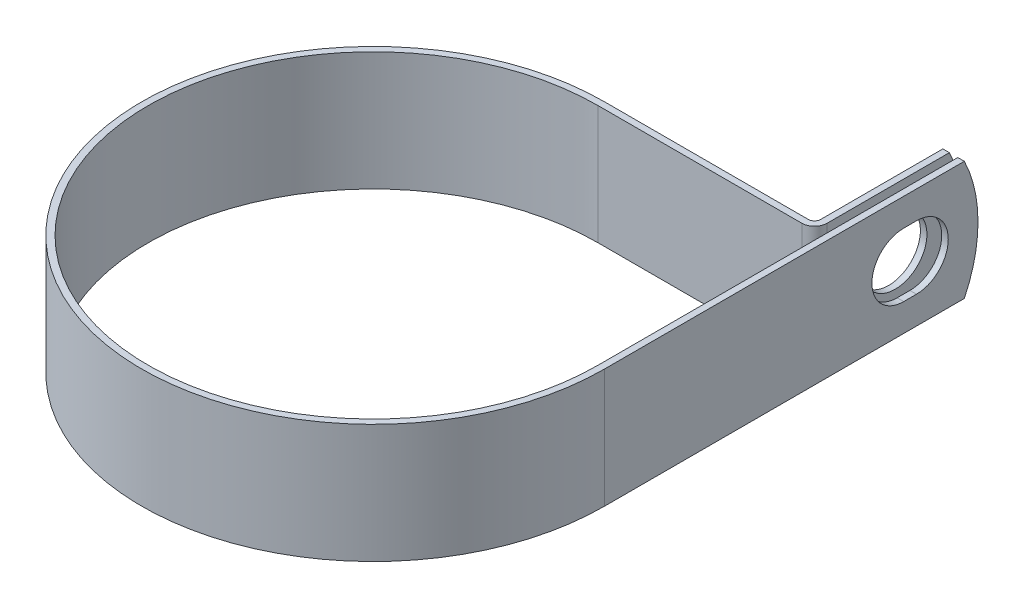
ISO-10303-21;
HEADER;
FILE_DESCRIPTION(('STEP AP214'),'2;1');
FILE_NAME('part.step','',(''),(''),'','','');
FILE_SCHEMA(('AUTOMOTIVE_DESIGN { 1 0 10303 214 1 1 1 1 }'));
ENDSEC;
DATA;
#1=APPLICATION_CONTEXT('core data for automotive mechanical design processes');
#2=APPLICATION_PROTOCOL_DEFINITION('international standard','automotive_design',2000,#1);
#3=PRODUCT_CONTEXT('',#1,'mechanical');
#4=PRODUCT('Part','Part','',(#3));
#5=PRODUCT_RELATED_PRODUCT_CATEGORY('part','',(#4));
#6=PRODUCT_DEFINITION_FORMATION('','',#4);
#7=PRODUCT_DEFINITION_CONTEXT('part definition',#1,'design');
#8=PRODUCT_DEFINITION('design','',#6,#7);
#9=PRODUCT_DEFINITION_SHAPE('','',#8);
#10=(LENGTH_UNIT() NAMED_UNIT(*) SI_UNIT(.MILLI.,.METRE.));
#11=(NAMED_UNIT(*) PLANE_ANGLE_UNIT() SI_UNIT($,.RADIAN.));
#12=(NAMED_UNIT(*) SI_UNIT($,.STERADIAN.) SOLID_ANGLE_UNIT());
#13=UNCERTAINTY_MEASURE_WITH_UNIT(LENGTH_MEASURE(1.E-05),#10,'distance_accuracy_value','');
#14=(GEOMETRIC_REPRESENTATION_CONTEXT(3) GLOBAL_UNCERTAINTY_ASSIGNED_CONTEXT((#13)) GLOBAL_UNIT_ASSIGNED_CONTEXT((#10,
#11,#12)) REPRESENTATION_CONTEXT('',''));
#15=CARTESIAN_POINT('',(0.,0.,0.));
#16=DIRECTION('',(0.,0.,1.));
#17=DIRECTION('',(1.,0.,0.));
#18=AXIS2_PLACEMENT_3D('',#15,#16,#17);
#19=CARTESIAN_POINT('',(42.0624,11.1125,0.));
#20=DIRECTION('',(-1.,0.,0.));
#21=DIRECTION('',(0.,0.,1.));
#22=AXIS2_PLACEMENT_3D('',#19,#20,#21);
#23=PLANE('',#22);
#24=DIRECTION('',(0.,0.,-1.));
#25=VECTOR('',#24,1.);
#26=CARTESIAN_POINT('',(42.0624,-5.9436,-55.9561999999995));
#27=LINE('',#26,#25);
#28=CARTESIAN_POINT('',(42.0624,-5.9436,-55.9561999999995));
#29=VERTEX_POINT('',#28);
#30=CARTESIAN_POINT('',(42.0624,-5.9436,-58.3438000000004));
#31=VERTEX_POINT('',#30);
#32=EDGE_CURVE('E236',#29,#31,#27,.T.);
#33=ORIENTED_EDGE('',*,*,#32,.T.);
#34=CARTESIAN_POINT('',(42.0624,0.,-58.3437999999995));
#35=DIRECTION('',(-1.,0.,0.));
#36=DIRECTION('',(0.,0.,1.));
#37=AXIS2_PLACEMENT_3D('',#34,#35,#36);
#38=CIRCLE('',#37,5.9436);
#39=CARTESIAN_POINT('',(42.0624,5.9436,-58.3438000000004));
#40=VERTEX_POINT('',#39);
#41=EDGE_CURVE('E257',#31,#40,#38,.F.);
#42=ORIENTED_EDGE('',*,*,#41,.T.);
#43=DIRECTION('',(0.,0.,1.));
#44=VECTOR('',#43,1.);
#45=CARTESIAN_POINT('',(42.0624,5.9436,-55.9561999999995));
#46=LINE('',#45,#44);
#47=CARTESIAN_POINT('',(42.0624,5.9436,-55.9561999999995));
#48=VERTEX_POINT('',#47);
#49=EDGE_CURVE('E253',#40,#48,#46,.T.);
#50=ORIENTED_EDGE('',*,*,#49,.T.);
#51=CARTESIAN_POINT('',(42.0624,0.,-55.9561999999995));
#52=DIRECTION('',(-1.,0.,0.));
#53=DIRECTION('',(0.,0.,1.));
#54=AXIS2_PLACEMENT_3D('',#51,#52,#53);
#55=CIRCLE('',#54,5.9436);
#56=EDGE_CURVE('E248',#48,#29,#55,.F.);
#57=ORIENTED_EDGE('',*,*,#56,.T.);
#58=EDGE_LOOP('',(#33,#42,#50,#57));
#59=FACE_BOUND('',#58,.T.);
#60=CARTESIAN_POINT('',(42.0624,0.,-44.45));
#61=DIRECTION('',(-1.,0.,0.));
#62=DIRECTION('',(0.,0.,1.));
#63=AXIS2_PLACEMENT_3D('',#60,#61,#62);
#64=CIRCLE('',#63,25.4);
#65=CARTESIAN_POINT('',(42.0624,11.1125,-67.2901476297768));
#66=VERTEX_POINT('',#65);
#67=CARTESIAN_POINT('',(42.0624,-11.1125,-67.2901476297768));
#68=VERTEX_POINT('',#67);
#69=EDGE_CURVE('E75',#66,#68,#64,.T.);
#70=ORIENTED_EDGE('',*,*,#69,.T.);
#71=DIRECTION('',(0.,0.,-1.));
#72=VECTOR('',#71,1.);
#73=CARTESIAN_POINT('',(42.0624,-11.1125,0.));
#74=LINE('',#73,#72);
#75=CARTESIAN_POINT('',(42.0624,-11.1125,0.));
#76=VERTEX_POINT('',#75);
#77=EDGE_CURVE('E271',#76,#68,#74,.T.);
#78=ORIENTED_EDGE('',*,*,#77,.F.);
#79=DIRECTION('',(0.,-1.,0.));
#80=VECTOR('',#79,1.);
#81=CARTESIAN_POINT('',(42.0624,11.1125,0.));
#82=LINE('',#81,#80);
#83=CARTESIAN_POINT('',(42.0624,11.1125,0.));
#84=VERTEX_POINT('',#83);
#85=EDGE_CURVE('E218',#84,#76,#82,.T.);
#86=ORIENTED_EDGE('',*,*,#85,.F.);
#87=DIRECTION('',(0.,0.,-1.));
#88=VECTOR('',#87,1.);
#89=CARTESIAN_POINT('',(42.0624,11.1125,-42.0624));
#90=LINE('',#89,#88);
#91=EDGE_CURVE('E273',#84,#66,#90,.T.);
#92=ORIENTED_EDGE('',*,*,#91,.T.);
#93=EDGE_LOOP('',(#70,#78,#86,#92));
#94=FACE_BOUND('',#93,.T.);
#95=ADVANCED_FACE('F54',(#59,#94),#23,.T.);
#96=CARTESIAN_POINT('',(40.4876,11.1125,-69.85));
#97=DIRECTION('',(1.,0.,0.));
#98=DIRECTION('',(0.,0.,-1.));
#99=AXIS2_PLACEMENT_3D('',#96,#97,#98);
#100=PLANE('',#99);
#101=CARTESIAN_POINT('',(40.4876,0.,-57.15));
#102=DIRECTION('',(1.,0.,0.));
#103=DIRECTION('',(0.,0.,-1.));
#104=AXIS2_PLACEMENT_3D('',#101,#102,#103);
#105=CIRCLE('',#104,5.9436);
#106=CARTESIAN_POINT('',(40.4876,0.,-63.0936));
#107=VERTEX_POINT('',#106);
#108=EDGE_CURVE('E268',#107,#107,#105,.F.);
#109=ORIENTED_EDGE('',*,*,#108,.T.);
#110=EDGE_LOOP('',(#109));
#111=FACE_BOUND('',#110,.T.);
#112=DIRECTION('',(0.,0.,1.));
#113=VECTOR('',#112,1.);
#114=CARTESIAN_POINT('',(40.4876,-11.1125,-69.85));
#115=LINE('',#114,#113);
#116=CARTESIAN_POINT('',(40.4876,-11.1125,-67.2901476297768));
#117=VERTEX_POINT('',#116);
#118=CARTESIAN_POINT('',(40.4876,-11.1125,-44.43984));
#119=VERTEX_POINT('',#118);
#120=EDGE_CURVE('E184',#117,#119,#115,.T.);
#121=ORIENTED_EDGE('',*,*,#120,.F.);
#122=CARTESIAN_POINT('',(40.4876,0.,-44.45));
#123=DIRECTION('',(1.,0.,0.));
#124=DIRECTION('',(0.,0.,-1.));
#125=AXIS2_PLACEMENT_3D('',#122,#123,#124);
#126=CIRCLE('',#125,25.4);
#127=CARTESIAN_POINT('',(40.4876,11.1125,-67.2901476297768));
#128=VERTEX_POINT('',#127);
#129=EDGE_CURVE('E176',#117,#128,#126,.T.);
#130=ORIENTED_EDGE('',*,*,#129,.T.);
#131=DIRECTION('',(0.,0.,1.));
#132=VECTOR('',#131,1.);
#133=CARTESIAN_POINT('',(40.4876,11.1125,-69.85));
#134=LINE('',#133,#132);
#135=CARTESIAN_POINT('',(40.4876,11.1125,-44.43984));
#136=VERTEX_POINT('',#135);
#137=EDGE_CURVE('E224',#128,#136,#134,.T.);
#138=ORIENTED_EDGE('',*,*,#137,.T.);
#139=DIRECTION('',(0.,-1.,0.));
#140=VECTOR('',#139,1.);
#141=CARTESIAN_POINT('',(40.4876,11.1125,-44.43984));
#142=LINE('',#141,#140);
#143=EDGE_CURVE('E211',#136,#119,#142,.T.);
#144=ORIENTED_EDGE('',*,*,#143,.T.);
#145=EDGE_LOOP('',(#121,#130,#138,#144));
#146=FACE_BOUND('',#145,.T.);
#147=ADVANCED_FACE('F226',(#111,#146),#100,.T.);
#148=CARTESIAN_POINT('',(39.2684,11.1125,-69.85));
#149=DIRECTION('',(1.,0.,0.));
#150=DIRECTION('',(0.,0.,-1.));
#151=AXIS2_PLACEMENT_3D('',#148,#149,#150);
#152=PLANE('',#151);
#153=CARTESIAN_POINT('',(39.2684,0.,-57.15));
#154=DIRECTION('',(-1.,0.,0.));
#155=DIRECTION('',(0.,0.,1.));
#156=AXIS2_PLACEMENT_3D('',#153,#154,#155);
#157=CIRCLE('',#156,5.9436);
#158=CARTESIAN_POINT('',(39.2684,0.,-51.2064));
#159=VERTEX_POINT('',#158);
#160=EDGE_CURVE('E265',#159,#159,#157,.T.);
#161=ORIENTED_EDGE('',*,*,#160,.F.);
#162=EDGE_LOOP('',(#161));
#163=FACE_BOUND('',#162,.T.);
#164=CARTESIAN_POINT('',(39.2684,0.,-44.45));
#165=DIRECTION('',(-1.,0.,0.));
#166=DIRECTION('',(0.,0.,1.));
#167=AXIS2_PLACEMENT_3D('',#164,#165,#166);
#168=CIRCLE('',#167,25.4);
#169=CARTESIAN_POINT('',(39.2684,11.1125,-67.2901476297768));
#170=VERTEX_POINT('',#169);
#171=CARTESIAN_POINT('',(39.2684,-11.1125,-67.2901476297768));
#172=VERTEX_POINT('',#171);
#173=EDGE_CURVE('E67',#170,#172,#168,.T.);
#174=ORIENTED_EDGE('',*,*,#173,.T.);
#175=DIRECTION('',(0.,0.,1.));
#176=VECTOR('',#175,1.);
#177=CARTESIAN_POINT('',(39.2684,-11.1125,-69.85));
#178=LINE('',#177,#176);
#179=CARTESIAN_POINT('',(39.2684,-11.1125,-44.43984));
#180=VERTEX_POINT('',#179);
#181=EDGE_CURVE('E167',#172,#180,#178,.T.);
#182=ORIENTED_EDGE('',*,*,#181,.T.);
#183=DIRECTION('',(0.,-1.,0.));
#184=VECTOR('',#183,1.);
#185=CARTESIAN_POINT('',(39.2684,11.1125,-44.43984));
#186=LINE('',#185,#184);
#187=CARTESIAN_POINT('',(39.2684,11.1125,-44.43984));
#188=VERTEX_POINT('',#187);
#189=EDGE_CURVE('E209',#188,#180,#186,.T.);
#190=ORIENTED_EDGE('',*,*,#189,.F.);
#191=DIRECTION('',(0.,0.,1.));
#192=VECTOR('',#191,1.);
#193=CARTESIAN_POINT('',(39.2684,11.1125,-69.85));
#194=LINE('',#193,#192);
#195=EDGE_CURVE('E169',#170,#188,#194,.T.);
#196=ORIENTED_EDGE('',*,*,#195,.F.);
#197=EDGE_LOOP('',(#174,#182,#190,#196));
#198=FACE_BOUND('',#197,.T.);
#199=ADVANCED_FACE('F164',(#163,#198),#152,.F.);
#200=CARTESIAN_POINT('',(43.2816,11.1125,0.));
#201=DIRECTION('',(-1.,0.,0.));
#202=DIRECTION('',(0.,0.,1.));
#203=AXIS2_PLACEMENT_3D('',#200,#201,#202);
#204=PLANE('',#203);
#205=CARTESIAN_POINT('',(43.2816,0.,-58.3437999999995));
#206=DIRECTION('',(1.,0.,0.));
#207=DIRECTION('',(0.,0.,-1.));
#208=AXIS2_PLACEMENT_3D('',#205,#206,#207);
#209=CIRCLE('',#208,5.9436);
#210=CARTESIAN_POINT('',(43.2816,-5.9436,-58.3438000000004));
#211=VERTEX_POINT('',#210);
#212=CARTESIAN_POINT('',(43.2816,5.9436,-58.3438000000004));
#213=VERTEX_POINT('',#212);
#214=EDGE_CURVE('E237',#211,#213,#209,.T.);
#215=ORIENTED_EDGE('',*,*,#214,.F.);
#216=DIRECTION('',(0.,0.,-1.));
#217=VECTOR('',#216,1.);
#218=CARTESIAN_POINT('',(43.2816,-5.9436,-55.9561999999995));
#219=LINE('',#218,#217);
#220=CARTESIAN_POINT('',(43.2816,-5.9436,-55.9561999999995));
#221=VERTEX_POINT('',#220);
#222=EDGE_CURVE('E240',#221,#211,#219,.T.);
#223=ORIENTED_EDGE('',*,*,#222,.F.);
#224=CARTESIAN_POINT('',(43.2816,0.,-55.9561999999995));
#225=DIRECTION('',(1.,0.,0.));
#226=DIRECTION('',(0.,0.,-1.));
#227=AXIS2_PLACEMENT_3D('',#224,#225,#226);
#228=CIRCLE('',#227,5.9436);
#229=CARTESIAN_POINT('',(43.2816,5.9436,-55.9561999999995));
#230=VERTEX_POINT('',#229);
#231=EDGE_CURVE('E230',#230,#221,#228,.T.);
#232=ORIENTED_EDGE('',*,*,#231,.F.);
#233=DIRECTION('',(0.,0.,1.));
#234=VECTOR('',#233,1.);
#235=CARTESIAN_POINT('',(43.2816,5.9436,-55.9561999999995));
#236=LINE('',#235,#234);
#237=EDGE_CURVE('E234',#213,#230,#236,.T.);
#238=ORIENTED_EDGE('',*,*,#237,.F.);
#239=EDGE_LOOP('',(#215,#223,#232,#238));
#240=FACE_BOUND('',#239,.T.);
#241=DIRECTION('',(0.,0.,-1.));
#242=VECTOR('',#241,1.);
#243=CARTESIAN_POINT('',(43.2816,-11.1125,0.));
#244=LINE('',#243,#242);
#245=CARTESIAN_POINT('',(43.2816,-11.1125,0.));
#246=VERTEX_POINT('',#245);
#247=CARTESIAN_POINT('',(43.2816,-11.1125,-67.2901476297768));
#248=VERTEX_POINT('',#247);
#249=EDGE_CURVE('E195',#246,#248,#244,.T.);
#250=ORIENTED_EDGE('',*,*,#249,.T.);
#251=CARTESIAN_POINT('',(43.2816,0.,-44.45));
#252=DIRECTION('',(-1.,0.,0.));
#253=DIRECTION('',(0.,0.,1.));
#254=AXIS2_PLACEMENT_3D('',#251,#252,#253);
#255=CIRCLE('',#254,25.4);
#256=CARTESIAN_POINT('',(43.2816,11.1125,-67.2901476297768));
#257=VERTEX_POINT('',#256);
#258=EDGE_CURVE('E170',#257,#248,#255,.T.);
#259=ORIENTED_EDGE('',*,*,#258,.F.);
#260=DIRECTION('',(0.,0.,-1.));
#261=VECTOR('',#260,1.);
#262=CARTESIAN_POINT('',(43.2816,11.1125,-42.0624));
#263=LINE('',#262,#261);
#264=CARTESIAN_POINT('',(43.2816,11.1125,0.));
#265=VERTEX_POINT('',#264);
#266=EDGE_CURVE('E198',#265,#257,#263,.T.);
#267=ORIENTED_EDGE('',*,*,#266,.F.);
#268=DIRECTION('',(0.,-1.,0.));
#269=VECTOR('',#268,1.);
#270=CARTESIAN_POINT('',(43.2816,11.1125,0.));
#271=LINE('',#270,#269);
#272=EDGE_CURVE('E199',#265,#246,#271,.T.);
#273=ORIENTED_EDGE('',*,*,#272,.T.);
#274=EDGE_LOOP('',(#250,#259,#267,#273));
#275=FACE_BOUND('',#274,.T.);
#276=ADVANCED_FACE('F321',(#240,#275),#204,.F.);
#277=CARTESIAN_POINT('',(0.,-11.1125,0.));
#278=DIRECTION('',(0.,1.,0.));
#279=DIRECTION('',(1.,0.,0.));
#280=AXIS2_PLACEMENT_3D('',#277,#278,#279);
#281=PLANE('',#280);
#282=DIRECTION('',(-1.,0.,0.));
#283=VECTOR('',#282,1.);
#284=CARTESIAN_POINT('',(43.2816,-11.1125,-67.2901476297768));
#285=LINE('',#284,#283);
#286=EDGE_CURVE('E171',#248,#68,#285,.T.);
#287=ORIENTED_EDGE('',*,*,#286,.F.);
#288=ORIENTED_EDGE('',*,*,#249,.F.);
#289=CARTESIAN_POINT('',(0.,-11.1125,0.));
#290=DIRECTION('',(0.,1.,0.));
#291=DIRECTION('',(1.,0.,0.));
#292=AXIS2_PLACEMENT_3D('',#289,#290,#291);
#293=CIRCLE('',#292,43.2816);
#294=CARTESIAN_POINT('',(0.,-11.1125,-43.2816));
#295=VERTEX_POINT('',#294);
#296=EDGE_CURVE('E193',#295,#246,#293,.T.);
#297=ORIENTED_EDGE('',*,*,#296,.F.);
#298=DIRECTION('',(1.,0.,0.));
#299=VECTOR('',#298,1.);
#300=CARTESIAN_POINT('',(0.,-11.1125,-43.2816));
#301=LINE('',#300,#299);
#302=CARTESIAN_POINT('',(38.11016,-11.1125,-43.2816));
#303=VERTEX_POINT('',#302);
#304=EDGE_CURVE('E186',#303,#295,#301,.F.);
#305=ORIENTED_EDGE('',*,*,#304,.F.);
#306=CARTESIAN_POINT('',(38.11016,-11.1125,-44.43984));
#307=DIRECTION('',(0.,1.,0.));
#308=DIRECTION('',(1.,0.,0.));
#309=AXIS2_PLACEMENT_3D('',#306,#307,#308);
#310=CIRCLE('',#309,1.15824);
#311=EDGE_CURVE('E183',#180,#303,#310,.F.);
#312=ORIENTED_EDGE('',*,*,#311,.F.);
#313=ORIENTED_EDGE('',*,*,#181,.F.);
#314=DIRECTION('',(-1.,0.,0.));
#315=VECTOR('',#314,1.);
#316=CARTESIAN_POINT('',(43.2816,-11.1125,-67.2901476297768));
#317=LINE('',#316,#315);
#318=EDGE_CURVE('E12',#117,#172,#317,.T.);
#319=ORIENTED_EDGE('',*,*,#318,.F.);
#320=ORIENTED_EDGE('',*,*,#120,.T.);
#321=CARTESIAN_POINT('',(38.11016,-11.1125,-44.43984));
#322=DIRECTION('',(0.,-1.,0.));
#323=DIRECTION('',(0.,0.,1.));
#324=AXIS2_PLACEMENT_3D('',#321,#322,#323);
#325=CIRCLE('',#324,2.37744);
#326=CARTESIAN_POINT('',(38.11016,-11.1125,-42.0624));
#327=VERTEX_POINT('',#326);
#328=EDGE_CURVE('E188',#119,#327,#325,.T.);
#329=ORIENTED_EDGE('',*,*,#328,.T.);
#330=DIRECTION('',(-1.,0.,0.));
#331=VECTOR('',#330,1.);
#332=CARTESIAN_POINT('',(0.,-11.1125,-42.0624));
#333=LINE('',#332,#331);
#334=CARTESIAN_POINT('',(0.,-11.1125,-42.0624));
#335=VERTEX_POINT('',#334);
#336=EDGE_CURVE('E298',#327,#335,#333,.T.);
#337=ORIENTED_EDGE('',*,*,#336,.T.);
#338=CARTESIAN_POINT('',(0.,-11.1125,0.));
#339=DIRECTION('',(0.,1.,0.));
#340=DIRECTION('',(0.,0.,1.));
#341=AXIS2_PLACEMENT_3D('',#338,#339,#340);
#342=CIRCLE('',#341,42.0624);
#343=EDGE_CURVE('E295',#335,#76,#342,.T.);
#344=ORIENTED_EDGE('',*,*,#343,.T.);
#345=ORIENTED_EDGE('',*,*,#77,.T.);
#346=EDGE_LOOP('',(#287,#288,#297,#305,#312,#313,#319,#320,#329,#337,#344,#345));
#347=FACE_BOUND('',#346,.T.);
#348=ADVANCED_FACE('F181',(#347),#281,.F.);
#349=CARTESIAN_POINT('',(0.,11.1125,0.));
#350=DIRECTION('',(0.,1.,0.));
#351=DIRECTION('',(1.,0.,0.));
#352=AXIS2_PLACEMENT_3D('',#349,#350,#351);
#353=PLANE('',#352);
#354=ORIENTED_EDGE('',*,*,#266,.T.);
#355=DIRECTION('',(-1.,0.,0.));
#356=VECTOR('',#355,1.);
#357=CARTESIAN_POINT('',(43.2816,11.1125,-67.2901476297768));
#358=LINE('',#357,#356);
#359=EDGE_CURVE('E228',#257,#66,#358,.T.);
#360=ORIENTED_EDGE('',*,*,#359,.T.);
#361=ORIENTED_EDGE('',*,*,#91,.F.);
#362=CARTESIAN_POINT('',(0.,11.1125,0.));
#363=DIRECTION('',(0.,1.,0.));
#364=DIRECTION('',(0.,0.,1.));
#365=AXIS2_PLACEMENT_3D('',#362,#363,#364);
#366=CIRCLE('',#365,42.0624);
#367=CARTESIAN_POINT('',(0.,11.1125,-42.0624));
#368=VERTEX_POINT('',#367);
#369=EDGE_CURVE('E276',#368,#84,#366,.T.);
#370=ORIENTED_EDGE('',*,*,#369,.F.);
#371=DIRECTION('',(-1.,0.,0.));
#372=VECTOR('',#371,1.);
#373=CARTESIAN_POINT('',(0.,11.1125,-42.0624));
#374=LINE('',#373,#372);
#375=CARTESIAN_POINT('',(38.11016,11.1125,-42.0624));
#376=VERTEX_POINT('',#375);
#377=EDGE_CURVE('E279',#376,#368,#374,.T.);
#378=ORIENTED_EDGE('',*,*,#377,.F.);
#379=CARTESIAN_POINT('',(38.11016,11.1125,-44.43984));
#380=DIRECTION('',(0.,-1.,0.));
#381=DIRECTION('',(0.,0.,1.));
#382=AXIS2_PLACEMENT_3D('',#379,#380,#381);
#383=CIRCLE('',#382,2.37744);
#384=EDGE_CURVE('E282',#136,#376,#383,.T.);
#385=ORIENTED_EDGE('',*,*,#384,.F.);
#386=ORIENTED_EDGE('',*,*,#137,.F.);
#387=DIRECTION('',(-1.,0.,0.));
#388=VECTOR('',#387,1.);
#389=CARTESIAN_POINT('',(43.2816,11.1125,-67.2901476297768));
#390=LINE('',#389,#388);
#391=EDGE_CURVE('E61',#128,#170,#390,.T.);
#392=ORIENTED_EDGE('',*,*,#391,.T.);
#393=ORIENTED_EDGE('',*,*,#195,.T.);
#394=CARTESIAN_POINT('',(38.11016,11.1125,-44.43984));
#395=DIRECTION('',(0.,1.,0.));
#396=DIRECTION('',(1.,0.,0.));
#397=AXIS2_PLACEMENT_3D('',#394,#395,#396);
#398=CIRCLE('',#397,1.15824);
#399=CARTESIAN_POINT('',(38.11016,11.1125,-43.2816));
#400=VERTEX_POINT('',#399);
#401=EDGE_CURVE('E287',#188,#400,#398,.F.);
#402=ORIENTED_EDGE('',*,*,#401,.T.);
#403=DIRECTION('',(1.,0.,0.));
#404=VECTOR('',#403,1.);
#405=CARTESIAN_POINT('',(0.,11.1125,-43.2816));
#406=LINE('',#405,#404);
#407=CARTESIAN_POINT('',(0.,11.1125,-43.2816));
#408=VERTEX_POINT('',#407);
#409=EDGE_CURVE('E289',#400,#408,#406,.F.);
#410=ORIENTED_EDGE('',*,*,#409,.T.);
#411=CARTESIAN_POINT('',(0.,11.1125,0.));
#412=DIRECTION('',(0.,1.,0.));
#413=DIRECTION('',(1.,0.,0.));
#414=AXIS2_PLACEMENT_3D('',#411,#412,#413);
#415=CIRCLE('',#414,43.2816);
#416=EDGE_CURVE('E203',#408,#265,#415,.T.);
#417=ORIENTED_EDGE('',*,*,#416,.T.);
#418=EDGE_LOOP('',(#354,#360,#361,#370,#378,#385,#386,#392,#393,#402,#410,#417));
#419=FACE_BOUND('',#418,.T.);
#420=ADVANCED_FACE('F222',(#419),#353,.T.);
#421=CARTESIAN_POINT('',(0.,11.1125,0.));
#422=DIRECTION('',(0.,-1.,0.));
#423=DIRECTION('',(0.,0.,-1.));
#424=AXIS2_PLACEMENT_3D('',#421,#422,#423);
#425=CYLINDRICAL_SURFACE('',#424,42.0624);
#426=ORIENTED_EDGE('',*,*,#343,.F.);
#427=DIRECTION('',(0.,-1.,0.));
#428=VECTOR('',#427,1.);
#429=CARTESIAN_POINT('',(0.,11.1125,-42.0624));
#430=LINE('',#429,#428);
#431=EDGE_CURVE('E216',#368,#335,#430,.T.);
#432=ORIENTED_EDGE('',*,*,#431,.F.);
#433=ORIENTED_EDGE('',*,*,#369,.T.);
#434=ORIENTED_EDGE('',*,*,#85,.T.);
#435=EDGE_LOOP('',(#426,#432,#433,#434));
#436=FACE_BOUND('',#435,.T.);
#437=ADVANCED_FACE('F311',(#436),#425,.F.);
#438=CARTESIAN_POINT('',(0.,11.1125,-42.0624));
#439=DIRECTION('',(0.,0.,1.));
#440=DIRECTION('',(1.,0.,0.));
#441=AXIS2_PLACEMENT_3D('',#438,#439,#440);
#442=PLANE('',#441);
#443=ORIENTED_EDGE('',*,*,#336,.F.);
#444=DIRECTION('',(0.,-1.,0.));
#445=VECTOR('',#444,1.);
#446=CARTESIAN_POINT('',(38.11016,11.1125,-42.0624));
#447=LINE('',#446,#445);
#448=EDGE_CURVE('E214',#376,#327,#447,.T.);
#449=ORIENTED_EDGE('',*,*,#448,.F.);
#450=ORIENTED_EDGE('',*,*,#377,.T.);
#451=ORIENTED_EDGE('',*,*,#431,.T.);
#452=EDGE_LOOP('',(#443,#449,#450,#451));
#453=FACE_BOUND('',#452,.T.);
#454=ADVANCED_FACE('F307',(#453),#442,.T.);
#455=CARTESIAN_POINT('',(38.11016,11.1125,-44.43984));
#456=DIRECTION('',(0.,-1.,0.));
#457=DIRECTION('',(0.,0.,-1.));
#458=AXIS2_PLACEMENT_3D('',#455,#456,#457);
#459=CYLINDRICAL_SURFACE('',#458,2.37744);
#460=ORIENTED_EDGE('',*,*,#328,.F.);
#461=ORIENTED_EDGE('',*,*,#143,.F.);
#462=ORIENTED_EDGE('',*,*,#384,.T.);
#463=ORIENTED_EDGE('',*,*,#448,.T.);
#464=EDGE_LOOP('',(#460,#461,#462,#463));
#465=FACE_BOUND('',#464,.T.);
#466=ADVANCED_FACE('F304',(#465),#459,.T.);
#467=CARTESIAN_POINT('',(38.11016,11.1125,-44.43984));
#468=DIRECTION('',(0.,-1.,0.));
#469=DIRECTION('',(0.,0.,-1.));
#470=AXIS2_PLACEMENT_3D('',#467,#468,#469);
#471=CYLINDRICAL_SURFACE('',#470,1.15824);
#472=ORIENTED_EDGE('',*,*,#311,.T.);
#473=DIRECTION('',(0.,-1.,0.));
#474=VECTOR('',#473,1.);
#475=CARTESIAN_POINT('',(38.11016,11.1125,-43.2816));
#476=LINE('',#475,#474);
#477=EDGE_CURVE('E206',#400,#303,#476,.T.);
#478=ORIENTED_EDGE('',*,*,#477,.F.);
#479=ORIENTED_EDGE('',*,*,#401,.F.);
#480=ORIENTED_EDGE('',*,*,#189,.T.);
#481=EDGE_LOOP('',(#472,#478,#479,#480));
#482=FACE_BOUND('',#481,.T.);
#483=ADVANCED_FACE('F334',(#482),#471,.F.);
#484=CARTESIAN_POINT('',(0.,11.1125,-43.2816));
#485=DIRECTION('',(0.,0.,1.));
#486=DIRECTION('',(1.,0.,0.));
#487=AXIS2_PLACEMENT_3D('',#484,#485,#486);
#488=PLANE('',#487);
#489=ORIENTED_EDGE('',*,*,#304,.T.);
#490=DIRECTION('',(0.,-1.,0.));
#491=VECTOR('',#490,1.);
#492=CARTESIAN_POINT('',(0.,11.1125,-43.2816));
#493=LINE('',#492,#491);
#494=EDGE_CURVE('E202',#408,#295,#493,.T.);
#495=ORIENTED_EDGE('',*,*,#494,.F.);
#496=ORIENTED_EDGE('',*,*,#409,.F.);
#497=ORIENTED_EDGE('',*,*,#477,.T.);
#498=EDGE_LOOP('',(#489,#495,#496,#497));
#499=FACE_BOUND('',#498,.T.);
#500=ADVANCED_FACE('F330',(#499),#488,.F.);
#501=CARTESIAN_POINT('',(0.,11.1125,0.));
#502=DIRECTION('',(0.,-1.,0.));
#503=DIRECTION('',(0.,0.,-1.));
#504=AXIS2_PLACEMENT_3D('',#501,#502,#503);
#505=CYLINDRICAL_SURFACE('',#504,43.2816);
#506=ORIENTED_EDGE('',*,*,#296,.T.);
#507=ORIENTED_EDGE('',*,*,#272,.F.);
#508=ORIENTED_EDGE('',*,*,#416,.F.);
#509=ORIENTED_EDGE('',*,*,#494,.T.);
#510=EDGE_LOOP('',(#506,#507,#508,#509));
#511=FACE_BOUND('',#510,.T.);
#512=ADVANCED_FACE('F327',(#511),#505,.T.);
#513=CARTESIAN_POINT('',(57.2986394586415,0.,-57.15));
#514=DIRECTION('',(-1.,0.,0.));
#515=DIRECTION('',(0.,0.,1.));
#516=AXIS2_PLACEMENT_3D('',#513,#514,#515);
#517=CYLINDRICAL_SURFACE('',#516,5.9436);
#518=ORIENTED_EDGE('',*,*,#160,.T.);
#519=EDGE_LOOP('',(#518));
#520=FACE_BOUND('',#519,.T.);
#521=ORIENTED_EDGE('',*,*,#108,.F.);
#522=EDGE_LOOP('',(#521));
#523=FACE_BOUND('',#522,.T.);
#524=ADVANCED_FACE('F379',(#520,#523),#517,.F.);
#525=CARTESIAN_POINT('',(23.4861937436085,-5.9436,-55.9561999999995));
#526=DIRECTION('',(0.,-1.,0.));
#527=DIRECTION('',(0.,0.,-1.));
#528=AXIS2_PLACEMENT_3D('',#525,#526,#527);
#529=PLANE('',#528);
#530=DIRECTION('',(1.,0.,0.));
#531=VECTOR('',#530,1.);
#532=CARTESIAN_POINT('',(23.4861937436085,-5.9436,-55.9561999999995));
#533=LINE('',#532,#531);
#534=EDGE_CURVE('E251',#29,#221,#533,.T.);
#535=ORIENTED_EDGE('',*,*,#534,.T.);
#536=ORIENTED_EDGE('',*,*,#222,.T.);
#537=DIRECTION('',(1.,0.,0.));
#538=VECTOR('',#537,1.);
#539=CARTESIAN_POINT('',(23.4861937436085,-5.9436,-58.3438000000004));
#540=LINE('',#539,#538);
#541=EDGE_CURVE('E247',#31,#211,#540,.T.);
#542=ORIENTED_EDGE('',*,*,#541,.F.);
#543=ORIENTED_EDGE('',*,*,#32,.F.);
#544=EDGE_LOOP('',(#535,#536,#542,#543));
#545=FACE_BOUND('',#544,.T.);
#546=ADVANCED_FACE('F354',(#545),#529,.F.);
#547=CARTESIAN_POINT('',(23.4861937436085,0.,-58.3437999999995));
#548=DIRECTION('',(1.,0.,0.));
#549=DIRECTION('',(0.,0.,-1.));
#550=AXIS2_PLACEMENT_3D('',#547,#548,#549);
#551=CYLINDRICAL_SURFACE('',#550,5.9436);
#552=ORIENTED_EDGE('',*,*,#541,.T.);
#553=ORIENTED_EDGE('',*,*,#214,.T.);
#554=DIRECTION('',(1.,0.,0.));
#555=VECTOR('',#554,1.);
#556=CARTESIAN_POINT('',(23.4861937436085,5.9436,-58.3438000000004));
#557=LINE('',#556,#555);
#558=EDGE_CURVE('E256',#40,#213,#557,.T.);
#559=ORIENTED_EDGE('',*,*,#558,.F.);
#560=ORIENTED_EDGE('',*,*,#41,.F.);
#561=EDGE_LOOP('',(#552,#553,#559,#560));
#562=FACE_BOUND('',#561,.T.);
#563=ADVANCED_FACE('F358',(#562),#551,.F.);
#564=CARTESIAN_POINT('',(23.4861937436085,5.9436,-55.9561999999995));
#565=DIRECTION('',(0.,1.,0.));
#566=DIRECTION('',(0.,0.,1.));
#567=AXIS2_PLACEMENT_3D('',#564,#565,#566);
#568=PLANE('',#567);
#569=ORIENTED_EDGE('',*,*,#558,.T.);
#570=ORIENTED_EDGE('',*,*,#237,.T.);
#571=DIRECTION('',(1.,0.,0.));
#572=VECTOR('',#571,1.);
#573=CARTESIAN_POINT('',(23.4861937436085,5.9436,-55.9561999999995));
#574=LINE('',#573,#572);
#575=EDGE_CURVE('E252',#48,#230,#574,.T.);
#576=ORIENTED_EDGE('',*,*,#575,.F.);
#577=ORIENTED_EDGE('',*,*,#49,.F.);
#578=EDGE_LOOP('',(#569,#570,#576,#577));
#579=FACE_BOUND('',#578,.T.);
#580=ADVANCED_FACE('F362',(#579),#568,.F.);
#581=CARTESIAN_POINT('',(23.4861937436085,0.,-55.9561999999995));
#582=DIRECTION('',(1.,0.,0.));
#583=DIRECTION('',(0.,0.,-1.));
#584=AXIS2_PLACEMENT_3D('',#581,#582,#583);
#585=CYLINDRICAL_SURFACE('',#584,5.9436);
#586=ORIENTED_EDGE('',*,*,#575,.T.);
#587=ORIENTED_EDGE('',*,*,#231,.T.);
#588=ORIENTED_EDGE('',*,*,#534,.F.);
#589=ORIENTED_EDGE('',*,*,#56,.F.);
#590=EDGE_LOOP('',(#586,#587,#588,#589));
#591=FACE_BOUND('',#590,.T.);
#592=ADVANCED_FACE('F366',(#591),#585,.F.);
#593=CARTESIAN_POINT('',(43.2816,0.,-44.45));
#594=DIRECTION('',(-1.,0.,0.));
#595=DIRECTION('',(0.,0.,1.));
#596=AXIS2_PLACEMENT_3D('',#593,#594,#595);
#597=CYLINDRICAL_SURFACE('',#596,25.4);
#598=ORIENTED_EDGE('',*,*,#129,.F.);
#599=ORIENTED_EDGE('',*,*,#318,.T.);
#600=ORIENTED_EDGE('',*,*,#173,.F.);
#601=ORIENTED_EDGE('',*,*,#391,.F.);
#602=EDGE_LOOP('',(#598,#599,#600,#601));
#603=FACE_BOUND('',#602,.T.);
#604=ADVANCED_FACE('F174',(#603),#597,.T.);
#605=ORIENTED_EDGE('',*,*,#359,.F.);
#606=ORIENTED_EDGE('',*,*,#258,.T.);
#607=ORIENTED_EDGE('',*,*,#286,.T.);
#608=ORIENTED_EDGE('',*,*,#69,.F.);
#609=EDGE_LOOP('',(#605,#606,#607,#608));
#610=FACE_BOUND('',#609,.T.);
#611=ADVANCED_FACE('F316',(#610),#597,.T.);
#612=CLOSED_SHELL('',(#95,#147,#199,#276,#348,#420,#437,#454,#466,#483,#500,#512,#524,#546,#563,
#580,#592,#604,#611));
#613=MANIFOLD_SOLID_BREP('B2',#612);
#614=ADVANCED_BREP_SHAPE_REPRESENTATION('',(#18,#613),#14);
#615=SHAPE_DEFINITION_REPRESENTATION(#9,#614);
ENDSEC;
END-ISO-10303-21;
